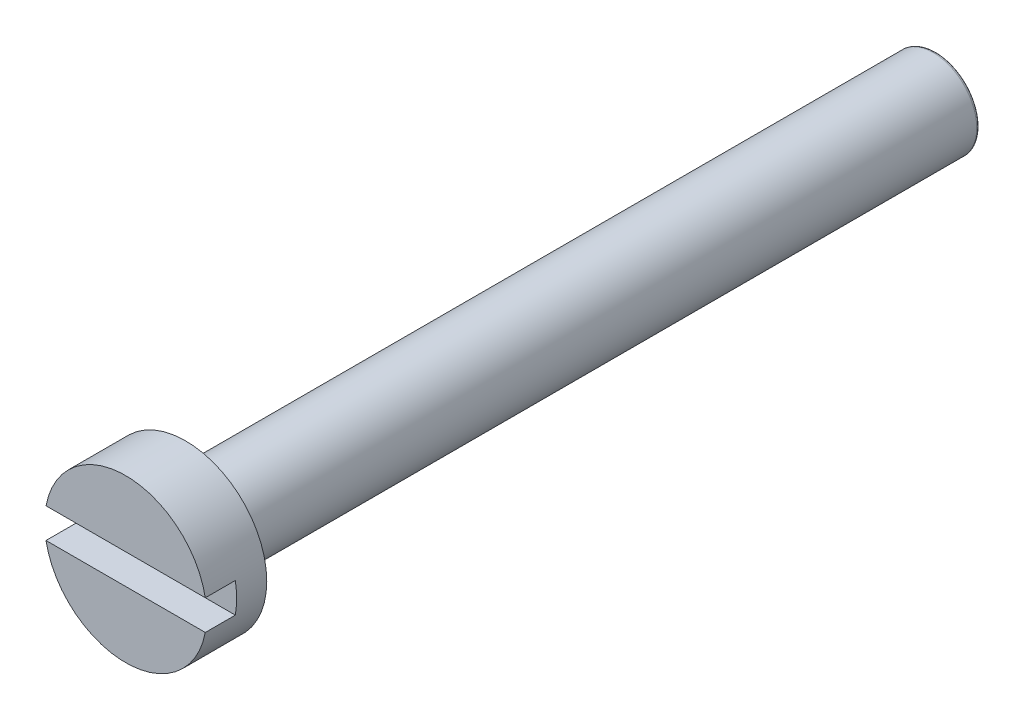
ISO-10303-21;
HEADER;
FILE_DESCRIPTION(('STEP AP214'),'2;1');
FILE_NAME('part.step','',(''),(''),'','','');
FILE_SCHEMA(('AUTOMOTIVE_DESIGN { 1 0 10303 214 1 1 1 1 }'));
ENDSEC;
DATA;
#1=APPLICATION_CONTEXT('core data for automotive mechanical design processes');
#2=APPLICATION_PROTOCOL_DEFINITION('international standard','automotive_design',2000,#1);
#3=PRODUCT_CONTEXT('',#1,'mechanical');
#4=PRODUCT('Part','Part','',(#3));
#5=PRODUCT_RELATED_PRODUCT_CATEGORY('part','',(#4));
#6=PRODUCT_DEFINITION_FORMATION('','',#4);
#7=PRODUCT_DEFINITION_CONTEXT('part definition',#1,'design');
#8=PRODUCT_DEFINITION('design','',#6,#7);
#9=PRODUCT_DEFINITION_SHAPE('','',#8);
#10=(LENGTH_UNIT() NAMED_UNIT(*) SI_UNIT(.MILLI.,.METRE.));
#11=(NAMED_UNIT(*) PLANE_ANGLE_UNIT() SI_UNIT($,.RADIAN.));
#12=(NAMED_UNIT(*) SI_UNIT($,.STERADIAN.) SOLID_ANGLE_UNIT());
#13=UNCERTAINTY_MEASURE_WITH_UNIT(LENGTH_MEASURE(1.E-05),#10,'distance_accuracy_value','');
#14=(GEOMETRIC_REPRESENTATION_CONTEXT(3) GLOBAL_UNCERTAINTY_ASSIGNED_CONTEXT((#13)) GLOBAL_UNIT_ASSIGNED_CONTEXT((#10,
#11,#12)) REPRESENTATION_CONTEXT('',''));
#15=CARTESIAN_POINT('',(0.,0.,0.));
#16=DIRECTION('',(0.,0.,1.));
#17=DIRECTION('',(1.,0.,0.));
#18=AXIS2_PLACEMENT_3D('',#15,#16,#17);
#19=CARTESIAN_POINT('',(0.,0.,0.));
#20=DIRECTION('',(0.,0.,1.));
#21=DIRECTION('',(1.,0.,0.));
#22=AXIS2_PLACEMENT_3D('',#19,#20,#21);
#23=PLANE('',#22);
#24=CARTESIAN_POINT('',(0.,0.,0.));
#25=DIRECTION('',(0.,0.,1.));
#26=DIRECTION('',(1.,0.,0.));
#27=AXIS2_PLACEMENT_3D('',#24,#25,#26);
#28=CIRCLE('',#27,2.7);
#29=CARTESIAN_POINT('',(2.7,0.,0.));
#30=VERTEX_POINT('',#29);
#31=EDGE_CURVE('E92',#30,#30,#28,.T.);
#32=ORIENTED_EDGE('',*,*,#31,.F.);
#33=EDGE_LOOP('',(#32));
#34=FACE_BOUND('',#33,.T.);
#35=CARTESIAN_POINT('',(0.,0.,0.));
#36=DIRECTION('',(0.,0.,1.));
#37=DIRECTION('',(1.,0.,0.));
#38=AXIS2_PLACEMENT_3D('',#35,#36,#37);
#39=CIRCLE('',#38,1.45);
#40=CARTESIAN_POINT('',(1.45,0.,0.));
#41=VERTEX_POINT('',#40);
#42=EDGE_CURVE('E103',#41,#41,#39,.F.);
#43=ORIENTED_EDGE('',*,*,#42,.F.);
#44=EDGE_LOOP('',(#43));
#45=FACE_BOUND('',#44,.T.);
#46=ADVANCED_FACE('F31',(#34,#45),#23,.F.);
#47=CARTESIAN_POINT('',(0.,0.,2.));
#48=DIRECTION('',(0.,0.,1.));
#49=DIRECTION('',(1.,0.,0.));
#50=AXIS2_PLACEMENT_3D('',#47,#48,#49);
#51=PLANE('',#50);
#52=DIRECTION('',(-1.,0.,0.));
#53=VECTOR('',#52,1.);
#54=CARTESIAN_POINT('',(0.,0.5,2.));
#55=LINE('',#54,#53);
#56=CARTESIAN_POINT('',(2.65329983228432,0.5,2.));
#57=VERTEX_POINT('',#56);
#58=CARTESIAN_POINT('',(-2.65329983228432,0.5,2.));
#59=VERTEX_POINT('',#58);
#60=EDGE_CURVE('E79',#57,#59,#55,.T.);
#61=ORIENTED_EDGE('',*,*,#60,.F.);
#62=CARTESIAN_POINT('',(0.,0.,2.));
#63=DIRECTION('',(0.,0.,1.));
#64=DIRECTION('',(1.,0.,0.));
#65=AXIS2_PLACEMENT_3D('',#62,#63,#64);
#66=CIRCLE('',#65,2.7);
#67=EDGE_CURVE('E80',#57,#59,#66,.T.);
#68=ORIENTED_EDGE('',*,*,#67,.T.);
#69=EDGE_LOOP('',(#61,#68));
#70=FACE_BOUND('',#69,.T.);
#71=ADVANCED_FACE('F121',(#70),#51,.T.);
#72=CARTESIAN_POINT('',(0.,0.,2.));
#73=DIRECTION('',(0.,0.,-1.));
#74=DIRECTION('',(-1.,0.,0.));
#75=AXIS2_PLACEMENT_3D('',#72,#73,#74);
#76=CYLINDRICAL_SURFACE('',#75,2.7);
#77=CARTESIAN_POINT('',(0.,0.,1.));
#78=DIRECTION('',(0.,0.,1.));
#79=DIRECTION('',(1.,0.,0.));
#80=AXIS2_PLACEMENT_3D('',#77,#78,#79);
#81=CIRCLE('',#80,2.7);
#82=CARTESIAN_POINT('',(-2.65329983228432,0.5,1.));
#83=VERTEX_POINT('',#82);
#84=CARTESIAN_POINT('',(-2.65329983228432,-0.5,1.));
#85=VERTEX_POINT('',#84);
#86=EDGE_CURVE('E102',#83,#85,#81,.T.);
#87=ORIENTED_EDGE('',*,*,#86,.F.);
#88=DIRECTION('',(0.,0.,-1.));
#89=VECTOR('',#88,1.);
#90=CARTESIAN_POINT('',(-2.65329983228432,0.5,2.));
#91=LINE('',#90,#89);
#92=EDGE_CURVE('E54',#83,#59,#91,.F.);
#93=ORIENTED_EDGE('',*,*,#92,.T.);
#94=ORIENTED_EDGE('',*,*,#67,.F.);
#95=DIRECTION('',(0.,0.,-1.));
#96=VECTOR('',#95,1.);
#97=CARTESIAN_POINT('',(2.65329983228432,0.5,2.));
#98=LINE('',#97,#96);
#99=CARTESIAN_POINT('',(2.65329983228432,0.5,1.));
#100=VERTEX_POINT('',#99);
#101=EDGE_CURVE('E96',#57,#100,#98,.T.);
#102=ORIENTED_EDGE('',*,*,#101,.T.);
#103=CARTESIAN_POINT('',(2.65329983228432,-0.5,1.));
#104=VERTEX_POINT('',#103);
#105=EDGE_CURVE('E88',#104,#100,#81,.T.);
#106=ORIENTED_EDGE('',*,*,#105,.F.);
#107=DIRECTION('',(0.,0.,-1.));
#108=VECTOR('',#107,1.);
#109=CARTESIAN_POINT('',(2.65329983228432,-0.5,2.));
#110=LINE('',#109,#108);
#111=CARTESIAN_POINT('',(2.65329983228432,-0.5,2.));
#112=VERTEX_POINT('',#111);
#113=EDGE_CURVE('E74',#104,#112,#110,.F.);
#114=ORIENTED_EDGE('',*,*,#113,.T.);
#115=CARTESIAN_POINT('',(-2.65329983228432,-0.5,2.));
#116=VERTEX_POINT('',#115);
#117=EDGE_CURVE('E86',#116,#112,#66,.T.);
#118=ORIENTED_EDGE('',*,*,#117,.F.);
#119=DIRECTION('',(0.,0.,-1.));
#120=VECTOR('',#119,1.);
#121=CARTESIAN_POINT('',(-2.65329983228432,-0.5,2.));
#122=LINE('',#121,#120);
#123=EDGE_CURVE('E46',#116,#85,#122,.T.);
#124=ORIENTED_EDGE('',*,*,#123,.T.);
#125=EDGE_LOOP('',(#87,#93,#94,#102,#106,#114,#118,#124));
#126=FACE_BOUND('',#125,.T.);
#127=ORIENTED_EDGE('',*,*,#31,.T.);
#128=EDGE_LOOP('',(#127));
#129=FACE_BOUND('',#128,.T.);
#130=ADVANCED_FACE('F33',(#126,#129),#76,.T.);
#131=DIRECTION('',(1.,0.,0.));
#132=VECTOR('',#131,1.);
#133=CARTESIAN_POINT('',(0.,-0.5,2.));
#134=LINE('',#133,#132);
#135=EDGE_CURVE('E71',#116,#112,#134,.T.);
#136=ORIENTED_EDGE('',*,*,#135,.F.);
#137=ORIENTED_EDGE('',*,*,#117,.T.);
#138=EDGE_LOOP('',(#136,#137));
#139=FACE_BOUND('',#138,.T.);
#140=ADVANCED_FACE('F91',(#139),#51,.T.);
#141=CARTESIAN_POINT('',(-10.,-0.5,1.));
#142=DIRECTION('',(0.,0.,1.));
#143=DIRECTION('',(1.,0.,0.));
#144=AXIS2_PLACEMENT_3D('',#141,#142,#143);
#145=PLANE('',#144);
#146=ORIENTED_EDGE('',*,*,#86,.T.);
#147=DIRECTION('',(1.,0.,0.));
#148=VECTOR('',#147,1.);
#149=CARTESIAN_POINT('',(-10.,-0.5,1.));
#150=LINE('',#149,#148);
#151=EDGE_CURVE('E188',#85,#104,#150,.T.);
#152=ORIENTED_EDGE('',*,*,#151,.T.);
#153=ORIENTED_EDGE('',*,*,#105,.T.);
#154=DIRECTION('',(-1.,0.,0.));
#155=VECTOR('',#154,1.);
#156=CARTESIAN_POINT('',(-10.,0.5,1.));
#157=LINE('',#156,#155);
#158=EDGE_CURVE('E89',#100,#83,#157,.T.);
#159=ORIENTED_EDGE('',*,*,#158,.T.);
#160=EDGE_LOOP('',(#146,#152,#153,#159));
#161=FACE_BOUND('',#160,.T.);
#162=ADVANCED_FACE('F135',(#161),#145,.T.);
#163=CARTESIAN_POINT('',(-10.,0.5,1.));
#164=DIRECTION('',(0.,1.,0.));
#165=DIRECTION('',(0.,0.,1.));
#166=AXIS2_PLACEMENT_3D('',#163,#164,#165);
#167=PLANE('',#166);
#168=ORIENTED_EDGE('',*,*,#60,.T.);
#169=ORIENTED_EDGE('',*,*,#92,.F.);
#170=ORIENTED_EDGE('',*,*,#158,.F.);
#171=ORIENTED_EDGE('',*,*,#101,.F.);
#172=EDGE_LOOP('',(#168,#169,#170,#171));
#173=FACE_BOUND('',#172,.T.);
#174=ADVANCED_FACE('F140',(#173),#167,.F.);
#175=CARTESIAN_POINT('',(-10.,-0.5,1.));
#176=DIRECTION('',(0.,-1.,0.));
#177=DIRECTION('',(0.,0.,-1.));
#178=AXIS2_PLACEMENT_3D('',#175,#176,#177);
#179=PLANE('',#178);
#180=ORIENTED_EDGE('',*,*,#135,.T.);
#181=ORIENTED_EDGE('',*,*,#113,.F.);
#182=ORIENTED_EDGE('',*,*,#151,.F.);
#183=ORIENTED_EDGE('',*,*,#123,.F.);
#184=EDGE_LOOP('',(#180,#181,#182,#183));
#185=FACE_BOUND('',#184,.T.);
#186=ADVANCED_FACE('F73',(#185),#179,.F.);
#187=CARTESIAN_POINT('',(0.,0.,-25.));
#188=DIRECTION('',(0.,0.,1.));
#189=DIRECTION('',(1.,0.,0.));
#190=AXIS2_PLACEMENT_3D('',#187,#188,#189);
#191=CYLINDRICAL_SURFACE('',#190,1.45);
#192=CARTESIAN_POINT('',(0.,0.,-24.9));
#193=DIRECTION('',(0.,0.,-1.));
#194=DIRECTION('',(-1.,0.,0.));
#195=AXIS2_PLACEMENT_3D('',#192,#193,#194);
#196=CIRCLE('',#195,1.45);
#197=CARTESIAN_POINT('',(-1.45,0.,-24.9));
#198=VERTEX_POINT('',#197);
#199=EDGE_CURVE('E11',#198,#198,#196,.F.);
#200=ORIENTED_EDGE('',*,*,#199,.T.);
#201=EDGE_LOOP('',(#200));
#202=FACE_BOUND('',#201,.T.);
#203=ORIENTED_EDGE('',*,*,#42,.T.);
#204=EDGE_LOOP('',(#203));
#205=FACE_BOUND('',#204,.T.);
#206=ADVANCED_FACE('F117',(#202,#205),#191,.T.);
#207=CARTESIAN_POINT('',(0.,0.,-25.));
#208=DIRECTION('',(0.,0.,-1.));
#209=DIRECTION('',(-1.,0.,0.));
#210=AXIS2_PLACEMENT_3D('',#207,#208,#209);
#211=PLANE('',#210);
#212=CARTESIAN_POINT('',(0.,0.,-25.));
#213=DIRECTION('',(0.,0.,-1.));
#214=DIRECTION('',(-1.,0.,0.));
#215=AXIS2_PLACEMENT_3D('',#212,#213,#214);
#216=CIRCLE('',#215,1.35);
#217=CARTESIAN_POINT('',(-1.35,0.,-25.));
#218=VERTEX_POINT('',#217);
#219=EDGE_CURVE('E39',#218,#218,#216,.T.);
#220=ORIENTED_EDGE('',*,*,#219,.T.);
#221=EDGE_LOOP('',(#220));
#222=FACE_BOUND('',#221,.T.);
#223=ADVANCED_FACE('F108',(#222),#211,.T.);
#224=CARTESIAN_POINT('',(0.,0.,-24.9));
#225=DIRECTION('',(0.,0.,-1.));
#226=DIRECTION('',(-1.,0.,0.));
#227=AXIS2_PLACEMENT_3D('',#224,#225,#226);
#228=TOROIDAL_SURFACE('',#227,1.35,0.1);
#229=ORIENTED_EDGE('',*,*,#199,.F.);
#230=EDGE_LOOP('',(#229));
#231=FACE_BOUND('',#230,.T.);
#232=ORIENTED_EDGE('',*,*,#219,.F.);
#233=EDGE_LOOP('',(#232));
#234=FACE_BOUND('',#233,.T.);
#235=ADVANCED_FACE('F110',(#231,#234),#228,.T.);
#236=CLOSED_SHELL('',(#46,#71,#130,#140,#162,#174,#186,#206,#223,#235));
#237=MANIFOLD_SOLID_BREP('B2',#236);
#238=ADVANCED_BREP_SHAPE_REPRESENTATION('',(#18,#237),#14);
#239=SHAPE_DEFINITION_REPRESENTATION(#9,#238);
ENDSEC;
END-ISO-10303-21;
